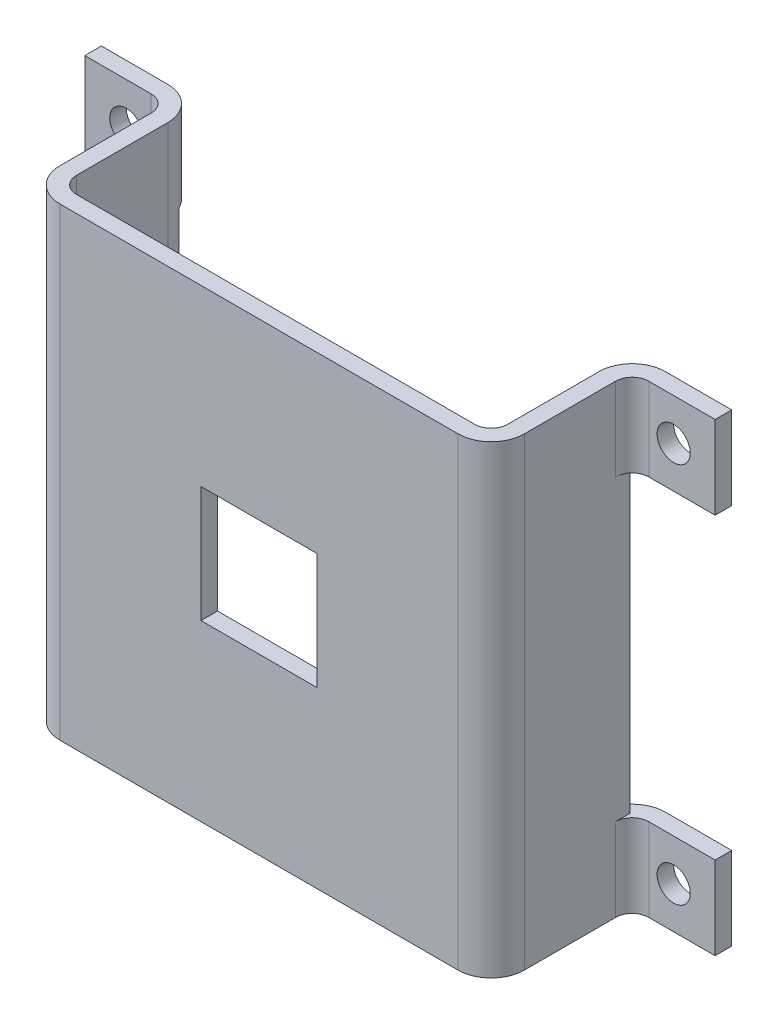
ISO-10303-21;
HEADER;
FILE_DESCRIPTION(('STEP AP214'),'2;1');
FILE_NAME('part.step','',(''),(''),'','','');
FILE_SCHEMA(('AUTOMOTIVE_DESIGN { 1 0 10303 214 1 1 1 1 }'));
ENDSEC;
DATA;
#1=APPLICATION_CONTEXT('core data for automotive mechanical design processes');
#2=APPLICATION_PROTOCOL_DEFINITION('international standard','automotive_design',2000,#1);
#3=PRODUCT_CONTEXT('',#1,'mechanical');
#4=PRODUCT('Part','Part','',(#3));
#5=PRODUCT_RELATED_PRODUCT_CATEGORY('part','',(#4));
#6=PRODUCT_DEFINITION_FORMATION('','',#4);
#7=PRODUCT_DEFINITION_CONTEXT('part definition',#1,'design');
#8=PRODUCT_DEFINITION('design','',#6,#7);
#9=PRODUCT_DEFINITION_SHAPE('','',#8);
#10=(LENGTH_UNIT() NAMED_UNIT(*) SI_UNIT(.MILLI.,.METRE.));
#11=(NAMED_UNIT(*) PLANE_ANGLE_UNIT() SI_UNIT($,.RADIAN.));
#12=(NAMED_UNIT(*) SI_UNIT($,.STERADIAN.) SOLID_ANGLE_UNIT());
#13=UNCERTAINTY_MEASURE_WITH_UNIT(LENGTH_MEASURE(1.E-05),#10,'distance_accuracy_value','');
#14=(GEOMETRIC_REPRESENTATION_CONTEXT(3) GLOBAL_UNCERTAINTY_ASSIGNED_CONTEXT((#13)) GLOBAL_UNIT_ASSIGNED_CONTEXT((#10,
#11,#12)) REPRESENTATION_CONTEXT('',''));
#15=CARTESIAN_POINT('',(0.,0.,0.));
#16=DIRECTION('',(0.,0.,1.));
#17=DIRECTION('',(1.,0.,0.));
#18=AXIS2_PLACEMENT_3D('',#15,#16,#17);
#19=CARTESIAN_POINT('',(14.,-14.,-8.5));
#20=DIRECTION('',(0.,0.,-1.));
#21=DIRECTION('',(-1.,0.,0.));
#22=AXIS2_PLACEMENT_3D('',#19,#20,#21);
#23=PLANE('',#22);
#24=CARTESIAN_POINT('',(16.5,-11.5,-8.5));
#25=DIRECTION('',(0.,0.,-1.));
#26=DIRECTION('',(-1.,0.,0.));
#27=AXIS2_PLACEMENT_3D('',#24,#25,#26);
#28=CIRCLE('',#27,1.);
#29=CARTESIAN_POINT('',(15.5,-11.5,-8.5));
#30=VERTEX_POINT('',#29);
#31=EDGE_CURVE('E388',#30,#30,#28,.T.);
#32=ORIENTED_EDGE('',*,*,#31,.F.);
#33=EDGE_LOOP('',(#32));
#34=FACE_BOUND('',#33,.T.);
#35=DIRECTION('',(-1.,0.,0.));
#36=VECTOR('',#35,1.);
#37=CARTESIAN_POINT('',(14.,-14.,-8.5));
#38=LINE('',#37,#36);
#39=CARTESIAN_POINT('',(19.,-14.,-8.5));
#40=VERTEX_POINT('',#39);
#41=CARTESIAN_POINT('',(15.,-14.,-8.5));
#42=VERTEX_POINT('',#41);
#43=EDGE_CURVE('E729',#40,#42,#38,.T.);
#44=ORIENTED_EDGE('',*,*,#43,.T.);
#45=DIRECTION('',(0.,1.,0.));
#46=VECTOR('',#45,1.);
#47=CARTESIAN_POINT('',(15.,14.,-8.5));
#48=LINE('',#47,#46);
#49=CARTESIAN_POINT('',(15.,-9.,-8.5));
#50=VERTEX_POINT('',#49);
#51=EDGE_CURVE('E695',#42,#50,#48,.T.);
#52=ORIENTED_EDGE('',*,*,#51,.T.);
#53=DIRECTION('',(-1.,0.,0.));
#54=VECTOR('',#53,1.);
#55=CARTESIAN_POINT('',(19.,-9.,-8.5));
#56=LINE('',#55,#54);
#57=CARTESIAN_POINT('',(19.,-9.,-8.5));
#58=VERTEX_POINT('',#57);
#59=EDGE_CURVE('E435',#58,#50,#56,.T.);
#60=ORIENTED_EDGE('',*,*,#59,.F.);
#61=DIRECTION('',(0.,1.,0.));
#62=VECTOR('',#61,1.);
#63=CARTESIAN_POINT('',(19.,-14.,-8.5));
#64=LINE('',#63,#62);
#65=EDGE_CURVE('E419',#40,#58,#64,.T.);
#66=ORIENTED_EDGE('',*,*,#65,.F.);
#67=EDGE_LOOP('',(#44,#52,#60,#66));
#68=FACE_BOUND('',#67,.T.);
#69=ADVANCED_FACE('F32',(#34,#68),#23,.T.);
#70=CARTESIAN_POINT('',(14.,14.,1.));
#71=DIRECTION('',(-1.,0.,0.));
#72=DIRECTION('',(0.,-1.,0.));
#73=AXIS2_PLACEMENT_3D('',#70,#71,#72);
#74=PLANE('',#73);
#75=DIRECTION('',(0.,0.,1.));
#76=VECTOR('',#75,1.);
#77=CARTESIAN_POINT('',(14.,-9.,-8.5));
#78=LINE('',#77,#76);
#79=CARTESIAN_POINT('',(14.,-9.,-7.36602540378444));
#80=VERTEX_POINT('',#79);
#81=CARTESIAN_POINT('',(14.,-9.,-6.5));
#82=VERTEX_POINT('',#81);
#83=EDGE_CURVE('E417',#80,#82,#78,.T.);
#84=ORIENTED_EDGE('',*,*,#83,.F.);
#85=DIRECTION('',(0.,-1.,0.));
#86=VECTOR('',#85,1.);
#87=CARTESIAN_POINT('',(14.,-9.,-7.36602540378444));
#88=LINE('',#87,#86);
#89=CARTESIAN_POINT('',(14.,9.,-7.36602540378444));
#90=VERTEX_POINT('',#89);
#91=EDGE_CURVE('E378',#90,#80,#88,.T.);
#92=ORIENTED_EDGE('',*,*,#91,.F.);
#93=DIRECTION('',(0.,0.,-1.));
#94=VECTOR('',#93,1.);
#95=CARTESIAN_POINT('',(14.,9.,-8.5));
#96=LINE('',#95,#94);
#97=CARTESIAN_POINT('',(14.,9.,-6.5));
#98=VERTEX_POINT('',#97);
#99=EDGE_CURVE('E438',#98,#90,#96,.T.);
#100=ORIENTED_EDGE('',*,*,#99,.F.);
#101=DIRECTION('',(0.,-1.,0.));
#102=VECTOR('',#101,1.);
#103=CARTESIAN_POINT('',(14.,14.,-6.5));
#104=LINE('',#103,#102);
#105=CARTESIAN_POINT('',(14.,14.,-6.5));
#106=VERTEX_POINT('',#105);
#107=EDGE_CURVE('E463',#98,#106,#104,.F.);
#108=ORIENTED_EDGE('',*,*,#107,.T.);
#109=DIRECTION('',(0.,0.,-1.));
#110=VECTOR('',#109,1.);
#111=CARTESIAN_POINT('',(14.,14.,1.));
#112=LINE('',#111,#110);
#113=CARTESIAN_POINT('',(14.,14.,-1.));
#114=VERTEX_POINT('',#113);
#115=EDGE_CURVE('E487',#114,#106,#112,.T.);
#116=ORIENTED_EDGE('',*,*,#115,.F.);
#117=DIRECTION('',(0.,1.,0.));
#118=VECTOR('',#117,1.);
#119=CARTESIAN_POINT('',(14.,-14.,-1.));
#120=LINE('',#119,#118);
#121=CARTESIAN_POINT('',(14.,-14.,-1.));
#122=VERTEX_POINT('',#121);
#123=EDGE_CURVE('E496',#114,#122,#120,.F.);
#124=ORIENTED_EDGE('',*,*,#123,.T.);
#125=DIRECTION('',(0.,0.,-1.));
#126=VECTOR('',#125,1.);
#127=CARTESIAN_POINT('',(14.,-14.,1.));
#128=LINE('',#127,#126);
#129=CARTESIAN_POINT('',(14.,-14.,-6.5));
#130=VERTEX_POINT('',#129);
#131=EDGE_CURVE('E460',#122,#130,#128,.T.);
#132=ORIENTED_EDGE('',*,*,#131,.T.);
#133=DIRECTION('',(0.,-1.,0.));
#134=VECTOR('',#133,1.);
#135=CARTESIAN_POINT('',(14.,-9.,-6.5));
#136=LINE('',#135,#134);
#137=EDGE_CURVE('E459',#130,#82,#136,.F.);
#138=ORIENTED_EDGE('',*,*,#137,.T.);
#139=EDGE_LOOP('',(#84,#92,#100,#108,#116,#124,#132,#138));
#140=FACE_BOUND('',#139,.T.);
#141=ADVANCED_FACE('F660',(#140),#74,.F.);
#142=CARTESIAN_POINT('',(0.,-14.,0.));
#143=DIRECTION('',(0.,0.,1.));
#144=DIRECTION('',(1.,0.,0.));
#145=AXIS2_PLACEMENT_3D('',#142,#143,#144);
#146=PLANE('',#145);
#147=DIRECTION('',(-1.,0.,0.));
#148=VECTOR('',#147,1.);
#149=CARTESIAN_POINT('',(0.,3.5,0.));
#150=LINE('',#149,#148);
#151=CARTESIAN_POINT('',(3.49999999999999,3.5,0.));
#152=VERTEX_POINT('',#151);
#153=CARTESIAN_POINT('',(-3.5,3.5,0.));
#154=VERTEX_POINT('',#153);
#155=EDGE_CURVE('E415',#152,#154,#150,.T.);
#156=ORIENTED_EDGE('',*,*,#155,.T.);
#157=DIRECTION('',(0.,1.,0.));
#158=VECTOR('',#157,1.);
#159=CARTESIAN_POINT('',(-3.49999999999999,-14.,0.));
#160=LINE('',#159,#158);
#161=CARTESIAN_POINT('',(-3.49999999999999,-3.5,0.));
#162=VERTEX_POINT('',#161);
#163=EDGE_CURVE('E617',#162,#154,#160,.T.);
#164=ORIENTED_EDGE('',*,*,#163,.F.);
#165=DIRECTION('',(1.,0.,0.));
#166=VECTOR('',#165,1.);
#167=CARTESIAN_POINT('',(0.,-3.5,0.));
#168=LINE('',#167,#166);
#169=CARTESIAN_POINT('',(3.5,-3.5,0.));
#170=VERTEX_POINT('',#169);
#171=EDGE_CURVE('E408',#162,#170,#168,.T.);
#172=ORIENTED_EDGE('',*,*,#171,.T.);
#173=DIRECTION('',(0.,1.,0.));
#174=VECTOR('',#173,1.);
#175=CARTESIAN_POINT('',(3.5,-14.,0.));
#176=LINE('',#175,#174);
#177=EDGE_CURVE('E412',#170,#152,#176,.T.);
#178=ORIENTED_EDGE('',*,*,#177,.T.);
#179=EDGE_LOOP('',(#156,#164,#172,#178));
#180=FACE_BOUND('',#179,.T.);
#181=DIRECTION('',(-1.,0.,0.));
#182=VECTOR('',#181,1.);
#183=CARTESIAN_POINT('',(0.,14.,0.));
#184=LINE('',#183,#182);
#185=CARTESIAN_POINT('',(12.,14.,0.));
#186=VERTEX_POINT('',#185);
#187=CARTESIAN_POINT('',(-12.,14.,0.));
#188=VERTEX_POINT('',#187);
#189=EDGE_CURVE('E473',#186,#188,#184,.T.);
#190=ORIENTED_EDGE('',*,*,#189,.F.);
#191=DIRECTION('',(0.,1.,0.));
#192=VECTOR('',#191,1.);
#193=CARTESIAN_POINT('',(12.,-14.,0.));
#194=LINE('',#193,#192);
#195=CARTESIAN_POINT('',(12.,-14.,0.));
#196=VERTEX_POINT('',#195);
#197=EDGE_CURVE('E472',#186,#196,#194,.F.);
#198=ORIENTED_EDGE('',*,*,#197,.T.);
#199=DIRECTION('',(1.,0.,0.));
#200=VECTOR('',#199,1.);
#201=CARTESIAN_POINT('',(0.,-14.,0.));
#202=LINE('',#201,#200);
#203=CARTESIAN_POINT('',(-12.,-14.,0.));
#204=VERTEX_POINT('',#203);
#205=EDGE_CURVE('E477',#204,#196,#202,.T.);
#206=ORIENTED_EDGE('',*,*,#205,.F.);
#207=DIRECTION('',(0.,1.,0.));
#208=VECTOR('',#207,1.);
#209=CARTESIAN_POINT('',(-12.,-14.,0.));
#210=LINE('',#209,#208);
#211=EDGE_CURVE('E577',#188,#204,#210,.F.);
#212=ORIENTED_EDGE('',*,*,#211,.F.);
#213=EDGE_LOOP('',(#190,#198,#206,#212));
#214=FACE_BOUND('',#213,.T.);
#215=ADVANCED_FACE('F667',(#180,#214),#146,.F.);
#216=CARTESIAN_POINT('',(0.,-14.,1.));
#217=DIRECTION('',(0.,1.,0.));
#218=DIRECTION('',(0.,0.,1.));
#219=AXIS2_PLACEMENT_3D('',#216,#217,#218);
#220=PLANE('',#219);
#221=DIRECTION('',(0.,0.,1.));
#222=VECTOR('',#221,1.);
#223=CARTESIAN_POINT('',(13.,-14.,-8.5));
#224=LINE('',#223,#222);
#225=CARTESIAN_POINT('',(13.,-14.,-6.5));
#226=VERTEX_POINT('',#225);
#227=CARTESIAN_POINT('',(13.,-14.,-1.));
#228=VERTEX_POINT('',#227);
#229=EDGE_CURVE('E503',#226,#228,#224,.T.);
#230=ORIENTED_EDGE('',*,*,#229,.F.);
#231=CARTESIAN_POINT('',(15.,-14.,-6.5));
#232=DIRECTION('',(0.,1.,0.));
#233=DIRECTION('',(0.,0.,1.));
#234=AXIS2_PLACEMENT_3D('',#231,#232,#233);
#235=CIRCLE('',#234,2.);
#236=EDGE_CURVE('E516',#226,#42,#235,.F.);
#237=ORIENTED_EDGE('',*,*,#236,.T.);
#238=ORIENTED_EDGE('',*,*,#43,.F.);
#239=DIRECTION('',(0.,0.,-1.));
#240=VECTOR('',#239,1.);
#241=CARTESIAN_POINT('',(19.,-14.,-8.5));
#242=LINE('',#241,#240);
#243=CARTESIAN_POINT('',(19.,-14.,-7.5));
#244=VERTEX_POINT('',#243);
#245=EDGE_CURVE('E426',#244,#40,#242,.T.);
#246=ORIENTED_EDGE('',*,*,#245,.F.);
#247=DIRECTION('',(-1.,0.,0.));
#248=VECTOR('',#247,1.);
#249=CARTESIAN_POINT('',(19.,-14.,-7.5));
#250=LINE('',#249,#248);
#251=CARTESIAN_POINT('',(15.,-14.,-7.5));
#252=VERTEX_POINT('',#251);
#253=EDGE_CURVE('E429',#244,#252,#250,.T.);
#254=ORIENTED_EDGE('',*,*,#253,.T.);
#255=CARTESIAN_POINT('',(15.,-14.,-6.5));
#256=DIRECTION('',(0.,1.,0.));
#257=DIRECTION('',(0.,0.,1.));
#258=AXIS2_PLACEMENT_3D('',#255,#256,#257);
#259=CIRCLE('',#258,1.);
#260=EDGE_CURVE('E706',#252,#130,#259,.T.);
#261=ORIENTED_EDGE('',*,*,#260,.T.);
#262=ORIENTED_EDGE('',*,*,#131,.F.);
#263=CARTESIAN_POINT('',(12.,-14.,-1.));
#264=DIRECTION('',(0.,1.,0.));
#265=DIRECTION('',(0.,0.,1.));
#266=AXIS2_PLACEMENT_3D('',#263,#264,#265);
#267=CIRCLE('',#266,2.);
#268=CARTESIAN_POINT('',(12.,-14.,1.));
#269=VERTEX_POINT('',#268);
#270=EDGE_CURVE('E55',#122,#269,#267,.F.);
#271=ORIENTED_EDGE('',*,*,#270,.T.);
#272=DIRECTION('',(1.,0.,0.));
#273=VECTOR('',#272,1.);
#274=CARTESIAN_POINT('',(0.,-14.,1.));
#275=LINE('',#274,#273);
#276=CARTESIAN_POINT('',(-12.,-14.,1.));
#277=VERTEX_POINT('',#276);
#278=EDGE_CURVE('E476',#277,#269,#275,.T.);
#279=ORIENTED_EDGE('',*,*,#278,.F.);
#280=CARTESIAN_POINT('',(-12.,-14.,-1.));
#281=DIRECTION('',(0.,-1.,0.));
#282=DIRECTION('',(0.,0.,1.));
#283=AXIS2_PLACEMENT_3D('',#280,#281,#282);
#284=CIRCLE('',#283,2.);
#285=CARTESIAN_POINT('',(-14.,-14.,-1.));
#286=VERTEX_POINT('',#285);
#287=EDGE_CURVE('E367',#286,#277,#284,.F.);
#288=ORIENTED_EDGE('',*,*,#287,.F.);
#289=DIRECTION('',(0.,0.,-1.));
#290=VECTOR('',#289,1.);
#291=CARTESIAN_POINT('',(-14.,-14.,1.));
#292=LINE('',#291,#290);
#293=CARTESIAN_POINT('',(-14.,-14.,-6.5));
#294=VERTEX_POINT('',#293);
#295=EDGE_CURVE('E341',#286,#294,#292,.T.);
#296=ORIENTED_EDGE('',*,*,#295,.T.);
#297=CARTESIAN_POINT('',(-15.,-14.,-6.5));
#298=DIRECTION('',(0.,-1.,0.));
#299=DIRECTION('',(0.,0.,1.));
#300=AXIS2_PLACEMENT_3D('',#297,#298,#299);
#301=CIRCLE('',#300,1.);
#302=CARTESIAN_POINT('',(-15.,-14.,-7.5));
#303=VERTEX_POINT('',#302);
#304=EDGE_CURVE('E570',#303,#294,#301,.T.);
#305=ORIENTED_EDGE('',*,*,#304,.F.);
#306=DIRECTION('',(1.,0.,0.));
#307=VECTOR('',#306,1.);
#308=CARTESIAN_POINT('',(-19.,-14.,-7.5));
#309=LINE('',#308,#307);
#310=CARTESIAN_POINT('',(-19.,-14.,-7.5));
#311=VERTEX_POINT('',#310);
#312=EDGE_CURVE('E602',#311,#303,#309,.T.);
#313=ORIENTED_EDGE('',*,*,#312,.F.);
#314=DIRECTION('',(0.,0.,-1.));
#315=VECTOR('',#314,1.);
#316=CARTESIAN_POINT('',(-19.,-14.,-8.5));
#317=LINE('',#316,#315);
#318=CARTESIAN_POINT('',(-19.,-14.,-8.5));
#319=VERTEX_POINT('',#318);
#320=EDGE_CURVE('E606',#311,#319,#317,.T.);
#321=ORIENTED_EDGE('',*,*,#320,.T.);
#322=DIRECTION('',(1.,0.,0.));
#323=VECTOR('',#322,1.);
#324=CARTESIAN_POINT('',(-14.,-14.,-8.5));
#325=LINE('',#324,#323);
#326=CARTESIAN_POINT('',(-15.,-14.,-8.5));
#327=VERTEX_POINT('',#326);
#328=EDGE_CURVE('E332',#319,#327,#325,.T.);
#329=ORIENTED_EDGE('',*,*,#328,.T.);
#330=CARTESIAN_POINT('',(-15.,-14.,-6.5));
#331=DIRECTION('',(0.,-1.,0.));
#332=DIRECTION('',(0.,0.,1.));
#333=AXIS2_PLACEMENT_3D('',#330,#331,#332);
#334=CIRCLE('',#333,2.);
#335=CARTESIAN_POINT('',(-13.,-14.,-6.5));
#336=VERTEX_POINT('',#335);
#337=EDGE_CURVE('E370',#336,#327,#334,.F.);
#338=ORIENTED_EDGE('',*,*,#337,.F.);
#339=DIRECTION('',(0.,0.,1.));
#340=VECTOR('',#339,1.);
#341=CARTESIAN_POINT('',(-13.,-14.,-8.5));
#342=LINE('',#341,#340);
#343=CARTESIAN_POINT('',(-13.,-14.,-1.));
#344=VERTEX_POINT('',#343);
#345=EDGE_CURVE('E347',#336,#344,#342,.T.);
#346=ORIENTED_EDGE('',*,*,#345,.T.);
#347=CARTESIAN_POINT('',(-12.,-14.,-1.));
#348=DIRECTION('',(0.,-1.,0.));
#349=DIRECTION('',(0.,0.,1.));
#350=AXIS2_PLACEMENT_3D('',#347,#348,#349);
#351=CIRCLE('',#350,1.);
#352=EDGE_CURVE('E552',#204,#344,#351,.T.);
#353=ORIENTED_EDGE('',*,*,#352,.F.);
#354=ORIENTED_EDGE('',*,*,#205,.T.);
#355=CARTESIAN_POINT('',(12.,-14.,-1.));
#356=DIRECTION('',(0.,1.,0.));
#357=DIRECTION('',(0.,0.,1.));
#358=AXIS2_PLACEMENT_3D('',#355,#356,#357);
#359=CIRCLE('',#358,1.);
#360=EDGE_CURVE('E696',#196,#228,#359,.T.);
#361=ORIENTED_EDGE('',*,*,#360,.T.);
#362=EDGE_LOOP('',(#230,#237,#238,#246,#254,#261,#262,#271,#279,#288,#296,#305,#313,#321,#329,
#338,#346,#353,#354,#361));
#363=FACE_BOUND('',#362,.T.);
#364=ADVANCED_FACE('F34',(#363),#220,.F.);
#365=CARTESIAN_POINT('',(0.,14.,1.));
#366=DIRECTION('',(0.,-1.,0.));
#367=DIRECTION('',(0.,0.,-1.));
#368=AXIS2_PLACEMENT_3D('',#365,#366,#367);
#369=PLANE('',#368);
#370=DIRECTION('',(1.,0.,0.));
#371=VECTOR('',#370,1.);
#372=CARTESIAN_POINT('',(14.,14.,-8.5));
#373=LINE('',#372,#371);
#374=CARTESIAN_POINT('',(15.,14.,-8.5));
#375=VERTEX_POINT('',#374);
#376=CARTESIAN_POINT('',(19.,14.,-8.5));
#377=VERTEX_POINT('',#376);
#378=EDGE_CURVE('E504',#375,#377,#373,.T.);
#379=ORIENTED_EDGE('',*,*,#378,.F.);
#380=CARTESIAN_POINT('',(15.,14.,-6.5));
#381=DIRECTION('',(0.,-1.,0.));
#382=DIRECTION('',(0.,0.,-1.));
#383=AXIS2_PLACEMENT_3D('',#380,#381,#382);
#384=CIRCLE('',#383,2.);
#385=CARTESIAN_POINT('',(13.,14.,-6.5));
#386=VERTEX_POINT('',#385);
#387=EDGE_CURVE('E512',#375,#386,#384,.F.);
#388=ORIENTED_EDGE('',*,*,#387,.T.);
#389=DIRECTION('',(0.,0.,1.));
#390=VECTOR('',#389,1.);
#391=CARTESIAN_POINT('',(13.,14.,-8.5));
#392=LINE('',#391,#390);
#393=CARTESIAN_POINT('',(13.,14.,-1.));
#394=VERTEX_POINT('',#393);
#395=EDGE_CURVE('E500',#386,#394,#392,.T.);
#396=ORIENTED_EDGE('',*,*,#395,.T.);
#397=CARTESIAN_POINT('',(12.,14.,-1.));
#398=DIRECTION('',(0.,-1.,0.));
#399=DIRECTION('',(0.,0.,-1.));
#400=AXIS2_PLACEMENT_3D('',#397,#398,#399);
#401=CIRCLE('',#400,1.);
#402=EDGE_CURVE('E700',#394,#186,#401,.T.);
#403=ORIENTED_EDGE('',*,*,#402,.T.);
#404=ORIENTED_EDGE('',*,*,#189,.T.);
#405=CARTESIAN_POINT('',(-12.,14.,-1.));
#406=DIRECTION('',(0.,1.,0.));
#407=DIRECTION('',(0.,0.,-1.));
#408=AXIS2_PLACEMENT_3D('',#405,#406,#407);
#409=CIRCLE('',#408,1.);
#410=CARTESIAN_POINT('',(-13.,14.,-1.));
#411=VERTEX_POINT('',#410);
#412=EDGE_CURVE('E543',#411,#188,#409,.T.);
#413=ORIENTED_EDGE('',*,*,#412,.F.);
#414=DIRECTION('',(0.,0.,1.));
#415=VECTOR('',#414,1.);
#416=CARTESIAN_POINT('',(-13.,14.,-8.5));
#417=LINE('',#416,#415);
#418=CARTESIAN_POINT('',(-13.,14.,-6.5));
#419=VERTEX_POINT('',#418);
#420=EDGE_CURVE('E338',#419,#411,#417,.T.);
#421=ORIENTED_EDGE('',*,*,#420,.F.);
#422=CARTESIAN_POINT('',(-15.,14.,-6.5));
#423=DIRECTION('',(0.,1.,0.));
#424=DIRECTION('',(0.,0.,-1.));
#425=AXIS2_PLACEMENT_3D('',#422,#423,#424);
#426=CIRCLE('',#425,2.);
#427=CARTESIAN_POINT('',(-15.,14.,-8.5));
#428=VERTEX_POINT('',#427);
#429=EDGE_CURVE('E364',#428,#419,#426,.F.);
#430=ORIENTED_EDGE('',*,*,#429,.F.);
#431=DIRECTION('',(-1.,0.,0.));
#432=VECTOR('',#431,1.);
#433=CARTESIAN_POINT('',(-14.,14.,-8.5));
#434=LINE('',#433,#432);
#435=CARTESIAN_POINT('',(-19.,14.,-8.5));
#436=VERTEX_POINT('',#435);
#437=EDGE_CURVE('E335',#428,#436,#434,.T.);
#438=ORIENTED_EDGE('',*,*,#437,.T.);
#439=DIRECTION('',(0.,0.,1.));
#440=VECTOR('',#439,1.);
#441=CARTESIAN_POINT('',(-19.,14.,-8.5));
#442=LINE('',#441,#440);
#443=CARTESIAN_POINT('',(-19.,14.,-7.5));
#444=VERTEX_POINT('',#443);
#445=EDGE_CURVE('E306',#436,#444,#442,.T.);
#446=ORIENTED_EDGE('',*,*,#445,.T.);
#447=DIRECTION('',(1.,0.,0.));
#448=VECTOR('',#447,1.);
#449=CARTESIAN_POINT('',(-19.,14.,-7.5));
#450=LINE('',#449,#448);
#451=CARTESIAN_POINT('',(-15.,14.,-7.5));
#452=VERTEX_POINT('',#451);
#453=EDGE_CURVE('E331',#444,#452,#450,.T.);
#454=ORIENTED_EDGE('',*,*,#453,.T.);
#455=CARTESIAN_POINT('',(-15.,14.,-6.5));
#456=DIRECTION('',(0.,1.,0.));
#457=DIRECTION('',(0.,0.,-1.));
#458=AXIS2_PLACEMENT_3D('',#455,#456,#457);
#459=CIRCLE('',#458,1.);
#460=CARTESIAN_POINT('',(-14.,14.,-6.5));
#461=VERTEX_POINT('',#460);
#462=EDGE_CURVE('E572',#461,#452,#459,.T.);
#463=ORIENTED_EDGE('',*,*,#462,.F.);
#464=DIRECTION('',(0.,0.,-1.));
#465=VECTOR('',#464,1.);
#466=CARTESIAN_POINT('',(-14.,14.,1.));
#467=LINE('',#466,#465);
#468=CARTESIAN_POINT('',(-14.,14.,-1.));
#469=VERTEX_POINT('',#468);
#470=EDGE_CURVE('E344',#469,#461,#467,.T.);
#471=ORIENTED_EDGE('',*,*,#470,.F.);
#472=CARTESIAN_POINT('',(-12.,14.,-1.));
#473=DIRECTION('',(0.,1.,0.));
#474=DIRECTION('',(0.,0.,-1.));
#475=AXIS2_PLACEMENT_3D('',#472,#473,#474);
#476=CIRCLE('',#475,2.);
#477=CARTESIAN_POINT('',(-12.,14.,1.));
#478=VERTEX_POINT('',#477);
#479=EDGE_CURVE('E354',#478,#469,#476,.F.);
#480=ORIENTED_EDGE('',*,*,#479,.F.);
#481=DIRECTION('',(-1.,0.,0.));
#482=VECTOR('',#481,1.);
#483=CARTESIAN_POINT('',(0.,14.,1.));
#484=LINE('',#483,#482);
#485=CARTESIAN_POINT('',(12.,14.,1.));
#486=VERTEX_POINT('',#485);
#487=EDGE_CURVE('E485',#486,#478,#484,.T.);
#488=ORIENTED_EDGE('',*,*,#487,.F.);
#489=CARTESIAN_POINT('',(12.,14.,-1.));
#490=DIRECTION('',(0.,-1.,0.));
#491=DIRECTION('',(0.,0.,-1.));
#492=AXIS2_PLACEMENT_3D('',#489,#490,#491);
#493=CIRCLE('',#492,2.);
#494=EDGE_CURVE('E499',#486,#114,#493,.F.);
#495=ORIENTED_EDGE('',*,*,#494,.T.);
#496=ORIENTED_EDGE('',*,*,#115,.T.);
#497=CARTESIAN_POINT('',(15.,14.,-6.5));
#498=DIRECTION('',(0.,-1.,0.));
#499=DIRECTION('',(0.,0.,-1.));
#500=AXIS2_PLACEMENT_3D('',#497,#498,#499);
#501=CIRCLE('',#500,1.);
#502=CARTESIAN_POINT('',(15.,14.,-7.5));
#503=VERTEX_POINT('',#502);
#504=EDGE_CURVE('E709',#106,#503,#501,.T.);
#505=ORIENTED_EDGE('',*,*,#504,.T.);
#506=DIRECTION('',(-1.,0.,0.));
#507=VECTOR('',#506,1.);
#508=CARTESIAN_POINT('',(19.,14.,-7.5));
#509=LINE('',#508,#507);
#510=CARTESIAN_POINT('',(19.,14.,-7.5));
#511=VERTEX_POINT('',#510);
#512=EDGE_CURVE('E509',#511,#503,#509,.T.);
#513=ORIENTED_EDGE('',*,*,#512,.F.);
#514=DIRECTION('',(0.,0.,1.));
#515=VECTOR('',#514,1.);
#516=CARTESIAN_POINT('',(19.,14.,-8.5));
#517=LINE('',#516,#515);
#518=EDGE_CURVE('E745',#377,#511,#517,.T.);
#519=ORIENTED_EDGE('',*,*,#518,.F.);
#520=EDGE_LOOP('',(#379,#388,#396,#403,#404,#413,#421,#430,#438,#446,#454,#463,#471,#480,#488,
#495,#496,#505,#513,#519));
#521=FACE_BOUND('',#520,.T.);
#522=ADVANCED_FACE('F527',(#521),#369,.F.);
#523=CARTESIAN_POINT('',(0.,-14.,1.));
#524=DIRECTION('',(0.,0.,1.));
#525=DIRECTION('',(1.,0.,0.));
#526=AXIS2_PLACEMENT_3D('',#523,#524,#525);
#527=PLANE('',#526);
#528=DIRECTION('',(0.,1.,0.));
#529=VECTOR('',#528,1.);
#530=CARTESIAN_POINT('',(-3.5,3.5,1.));
#531=LINE('',#530,#529);
#532=CARTESIAN_POINT('',(-3.49999999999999,-3.5,1.));
#533=VERTEX_POINT('',#532);
#534=CARTESIAN_POINT('',(-3.5,3.5,1.));
#535=VERTEX_POINT('',#534);
#536=EDGE_CURVE('E624',#533,#535,#531,.T.);
#537=ORIENTED_EDGE('',*,*,#536,.T.);
#538=DIRECTION('',(-1.,0.,0.));
#539=VECTOR('',#538,1.);
#540=CARTESIAN_POINT('',(0.,3.5,1.));
#541=LINE('',#540,#539);
#542=CARTESIAN_POINT('',(3.49999999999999,3.5,1.));
#543=VERTEX_POINT('',#542);
#544=EDGE_CURVE('E403',#543,#535,#541,.T.);
#545=ORIENTED_EDGE('',*,*,#544,.F.);
#546=DIRECTION('',(0.,1.,0.));
#547=VECTOR('',#546,1.);
#548=CARTESIAN_POINT('',(3.49999999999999,3.5,1.));
#549=LINE('',#548,#547);
#550=CARTESIAN_POINT('',(3.5,-3.5,1.));
#551=VERTEX_POINT('',#550);
#552=EDGE_CURVE('E400',#551,#543,#549,.T.);
#553=ORIENTED_EDGE('',*,*,#552,.F.);
#554=DIRECTION('',(1.,0.,0.));
#555=VECTOR('',#554,1.);
#556=CARTESIAN_POINT('',(0.,-3.5,1.));
#557=LINE('',#556,#555);
#558=EDGE_CURVE('E397',#533,#551,#557,.T.);
#559=ORIENTED_EDGE('',*,*,#558,.F.);
#560=EDGE_LOOP('',(#537,#545,#553,#559));
#561=FACE_BOUND('',#560,.T.);
#562=ORIENTED_EDGE('',*,*,#278,.T.);
#563=DIRECTION('',(0.,1.,0.));
#564=VECTOR('',#563,1.);
#565=CARTESIAN_POINT('',(12.,14.,1.));
#566=LINE('',#565,#564);
#567=EDGE_CURVE('E40',#269,#486,#566,.T.);
#568=ORIENTED_EDGE('',*,*,#567,.T.);
#569=ORIENTED_EDGE('',*,*,#487,.T.);
#570=DIRECTION('',(0.,1.,0.));
#571=VECTOR('',#570,1.);
#572=CARTESIAN_POINT('',(-12.,14.,1.));
#573=LINE('',#572,#571);
#574=EDGE_CURVE('E372',#277,#478,#573,.T.);
#575=ORIENTED_EDGE('',*,*,#574,.F.);
#576=EDGE_LOOP('',(#562,#568,#569,#575));
#577=FACE_BOUND('',#576,.T.);
#578=ADVANCED_FACE('F521',(#561,#577),#527,.T.);
#579=CARTESIAN_POINT('',(13.,14.,-8.5));
#580=DIRECTION('',(1.,0.,0.));
#581=DIRECTION('',(0.,1.,0.));
#582=AXIS2_PLACEMENT_3D('',#579,#580,#581);
#583=PLANE('',#582);
#584=ORIENTED_EDGE('',*,*,#395,.F.);
#585=DIRECTION('',(0.,1.,0.));
#586=VECTOR('',#585,1.);
#587=CARTESIAN_POINT('',(13.,-14.,-6.5));
#588=LINE('',#587,#586);
#589=EDGE_CURVE('E513',#386,#226,#588,.F.);
#590=ORIENTED_EDGE('',*,*,#589,.T.);
#591=ORIENTED_EDGE('',*,*,#229,.T.);
#592=DIRECTION('',(0.,1.,0.));
#593=VECTOR('',#592,1.);
#594=CARTESIAN_POINT('',(13.,14.,-1.));
#595=LINE('',#594,#593);
#596=EDGE_CURVE('E469',#228,#394,#595,.T.);
#597=ORIENTED_EDGE('',*,*,#596,.T.);
#598=EDGE_LOOP('',(#584,#590,#591,#597));
#599=FACE_BOUND('',#598,.T.);
#600=ADVANCED_FACE('F675',(#599),#583,.F.);
#601=CARTESIAN_POINT('',(16.5,11.5,-8.5));
#602=DIRECTION('',(0.,0.,-1.));
#603=DIRECTION('',(-1.,0.,0.));
#604=AXIS2_PLACEMENT_3D('',#601,#602,#603);
#605=CIRCLE('',#604,1.);
#606=CARTESIAN_POINT('',(15.5,11.5,-8.5));
#607=VERTEX_POINT('',#606);
#608=EDGE_CURVE('E394',#607,#607,#605,.T.);
#609=ORIENTED_EDGE('',*,*,#608,.F.);
#610=EDGE_LOOP('',(#609));
#611=FACE_BOUND('',#610,.T.);
#612=DIRECTION('',(-1.,0.,0.));
#613=VECTOR('',#612,1.);
#614=CARTESIAN_POINT('',(19.,9.,-8.5));
#615=LINE('',#614,#613);
#616=CARTESIAN_POINT('',(19.,9.,-8.5));
#617=VERTEX_POINT('',#616);
#618=CARTESIAN_POINT('',(15.,9.,-8.5));
#619=VERTEX_POINT('',#618);
#620=EDGE_CURVE('E449',#617,#619,#615,.T.);
#621=ORIENTED_EDGE('',*,*,#620,.T.);
#622=DIRECTION('',(0.,1.,0.));
#623=VECTOR('',#622,1.);
#624=CARTESIAN_POINT('',(15.,14.,-8.5));
#625=LINE('',#624,#623);
#626=EDGE_CURVE('E688',#619,#375,#625,.T.);
#627=ORIENTED_EDGE('',*,*,#626,.T.);
#628=ORIENTED_EDGE('',*,*,#378,.T.);
#629=DIRECTION('',(0.,1.,0.));
#630=VECTOR('',#629,1.);
#631=CARTESIAN_POINT('',(19.,14.,-8.5));
#632=LINE('',#631,#630);
#633=EDGE_CURVE('E441',#617,#377,#632,.T.);
#634=ORIENTED_EDGE('',*,*,#633,.F.);
#635=EDGE_LOOP('',(#621,#627,#628,#634));
#636=FACE_BOUND('',#635,.T.);
#637=ADVANCED_FACE('F663',(#611,#636),#23,.T.);
#638=CARTESIAN_POINT('',(19.,14.,-7.5));
#639=DIRECTION('',(0.,0.,-1.));
#640=DIRECTION('',(0.,1.,0.));
#641=AXIS2_PLACEMENT_3D('',#638,#639,#640);
#642=PLANE('',#641);
#643=CARTESIAN_POINT('',(16.5,11.5,-7.5));
#644=DIRECTION('',(0.,0.,1.));
#645=DIRECTION('',(1.,0.,0.));
#646=AXIS2_PLACEMENT_3D('',#643,#644,#645);
#647=CIRCLE('',#646,1.);
#648=CARTESIAN_POINT('',(17.5,11.5,-7.5));
#649=VERTEX_POINT('',#648);
#650=EDGE_CURVE('E391',#649,#649,#647,.T.);
#651=ORIENTED_EDGE('',*,*,#650,.F.);
#652=EDGE_LOOP('',(#651));
#653=FACE_BOUND('',#652,.T.);
#654=ORIENTED_EDGE('',*,*,#512,.T.);
#655=DIRECTION('',(0.,-1.,0.));
#656=VECTOR('',#655,1.);
#657=CARTESIAN_POINT('',(15.,9.,-7.5));
#658=LINE('',#657,#656);
#659=CARTESIAN_POINT('',(15.,9.,-7.5));
#660=VERTEX_POINT('',#659);
#661=EDGE_CURVE('E456',#503,#660,#658,.T.);
#662=ORIENTED_EDGE('',*,*,#661,.T.);
#663=DIRECTION('',(-1.,0.,0.));
#664=VECTOR('',#663,1.);
#665=CARTESIAN_POINT('',(19.,9.,-7.5));
#666=LINE('',#665,#664);
#667=CARTESIAN_POINT('',(19.,9.,-7.5));
#668=VERTEX_POINT('',#667);
#669=EDGE_CURVE('E452',#668,#660,#666,.T.);
#670=ORIENTED_EDGE('',*,*,#669,.F.);
#671=DIRECTION('',(0.,-1.,0.));
#672=VECTOR('',#671,1.);
#673=CARTESIAN_POINT('',(19.,14.,-7.5));
#674=LINE('',#673,#672);
#675=EDGE_CURVE('E744',#511,#668,#674,.T.);
#676=ORIENTED_EDGE('',*,*,#675,.F.);
#677=EDGE_LOOP('',(#654,#662,#670,#676));
#678=FACE_BOUND('',#677,.T.);
#679=ADVANCED_FACE('F674',(#653,#678),#642,.F.);
#680=CARTESIAN_POINT('',(19.,9.,-8.5));
#681=DIRECTION('',(0.,1.,0.));
#682=DIRECTION('',(-1.,0.,0.));
#683=AXIS2_PLACEMENT_3D('',#680,#681,#682);
#684=PLANE('',#683);
#685=ORIENTED_EDGE('',*,*,#99,.T.);
#686=DIRECTION('',(1.,0.,0.));
#687=VECTOR('',#686,1.);
#688=CARTESIAN_POINT('',(0.,9.,-7.36602540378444));
#689=LINE('',#688,#687);
#690=CARTESIAN_POINT('',(13.197224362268,9.,-7.36602540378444));
#691=VERTEX_POINT('',#690);
#692=EDGE_CURVE('E381',#691,#90,#689,.T.);
#693=ORIENTED_EDGE('',*,*,#692,.F.);
#694=CARTESIAN_POINT('',(15.,9.,-6.5));
#695=DIRECTION('',(0.,1.,0.));
#696=DIRECTION('',(-1.,0.,0.));
#697=AXIS2_PLACEMENT_3D('',#694,#695,#696);
#698=CIRCLE('',#697,2.);
#699=EDGE_CURVE('E47',#691,#619,#698,.F.);
#700=ORIENTED_EDGE('',*,*,#699,.T.);
#701=ORIENTED_EDGE('',*,*,#620,.F.);
#702=DIRECTION('',(0.,0.,-1.));
#703=VECTOR('',#702,1.);
#704=CARTESIAN_POINT('',(19.,9.,-8.5));
#705=LINE('',#704,#703);
#706=EDGE_CURVE('E453',#668,#617,#705,.T.);
#707=ORIENTED_EDGE('',*,*,#706,.F.);
#708=ORIENTED_EDGE('',*,*,#669,.T.);
#709=CARTESIAN_POINT('',(15.,9.,-6.5));
#710=DIRECTION('',(0.,1.,0.));
#711=DIRECTION('',(-1.,0.,0.));
#712=AXIS2_PLACEMENT_3D('',#709,#710,#711);
#713=CIRCLE('',#712,1.);
#714=EDGE_CURVE('E710',#660,#98,#713,.T.);
#715=ORIENTED_EDGE('',*,*,#714,.T.);
#716=EDGE_LOOP('',(#685,#693,#700,#701,#707,#708,#715));
#717=FACE_BOUND('',#716,.T.);
#718=ADVANCED_FACE('F681',(#717),#684,.F.);
#719=CARTESIAN_POINT('',(19.,9.,-8.5));
#720=DIRECTION('',(-1.,0.,0.));
#721=DIRECTION('',(0.,0.,1.));
#722=AXIS2_PLACEMENT_3D('',#719,#720,#721);
#723=PLANE('',#722);
#724=ORIENTED_EDGE('',*,*,#633,.T.);
#725=ORIENTED_EDGE('',*,*,#518,.T.);
#726=ORIENTED_EDGE('',*,*,#675,.T.);
#727=ORIENTED_EDGE('',*,*,#706,.T.);
#728=EDGE_LOOP('',(#724,#725,#726,#727));
#729=FACE_BOUND('',#728,.T.);
#730=ADVANCED_FACE('F749',(#729),#723,.F.);
#731=CARTESIAN_POINT('',(19.,-9.,-8.5));
#732=DIRECTION('',(0.,-1.,0.));
#733=DIRECTION('',(1.,0.,0.));
#734=AXIS2_PLACEMENT_3D('',#731,#732,#733);
#735=PLANE('',#734);
#736=ORIENTED_EDGE('',*,*,#59,.T.);
#737=CARTESIAN_POINT('',(15.,-9.,-6.5));
#738=DIRECTION('',(0.,-1.,0.));
#739=DIRECTION('',(1.,0.,0.));
#740=AXIS2_PLACEMENT_3D('',#737,#738,#739);
#741=CIRCLE('',#740,2.);
#742=CARTESIAN_POINT('',(13.197224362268,-9.,-7.36602540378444));
#743=VERTEX_POINT('',#742);
#744=EDGE_CURVE('E494',#50,#743,#741,.F.);
#745=ORIENTED_EDGE('',*,*,#744,.T.);
#746=DIRECTION('',(1.,0.,0.));
#747=VECTOR('',#746,1.);
#748=CARTESIAN_POINT('',(0.,-9.,-7.36602540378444));
#749=LINE('',#748,#747);
#750=EDGE_CURVE('E382',#743,#80,#749,.T.);
#751=ORIENTED_EDGE('',*,*,#750,.T.);
#752=ORIENTED_EDGE('',*,*,#83,.T.);
#753=CARTESIAN_POINT('',(15.,-9.,-6.5));
#754=DIRECTION('',(0.,-1.,0.));
#755=DIRECTION('',(1.,0.,0.));
#756=AXIS2_PLACEMENT_3D('',#753,#754,#755);
#757=CIRCLE('',#756,1.);
#758=CARTESIAN_POINT('',(15.,-9.,-7.5));
#759=VERTEX_POINT('',#758);
#760=EDGE_CURVE('E704',#82,#759,#757,.T.);
#761=ORIENTED_EDGE('',*,*,#760,.T.);
#762=DIRECTION('',(-1.,0.,0.));
#763=VECTOR('',#762,1.);
#764=CARTESIAN_POINT('',(19.,-9.,-7.5));
#765=LINE('',#764,#763);
#766=CARTESIAN_POINT('',(19.,-9.,-7.5));
#767=VERTEX_POINT('',#766);
#768=EDGE_CURVE('E432',#767,#759,#765,.T.);
#769=ORIENTED_EDGE('',*,*,#768,.F.);
#770=DIRECTION('',(0.,0.,1.));
#771=VECTOR('',#770,1.);
#772=CARTESIAN_POINT('',(19.,-9.,-8.5));
#773=LINE('',#772,#771);
#774=EDGE_CURVE('E422',#58,#767,#773,.T.);
#775=ORIENTED_EDGE('',*,*,#774,.F.);
#776=EDGE_LOOP('',(#736,#745,#751,#752,#761,#769,#775));
#777=FACE_BOUND('',#776,.T.);
#778=ADVANCED_FACE('F731',(#777),#735,.F.);
#779=CARTESIAN_POINT('',(19.,-14.,-7.5));
#780=DIRECTION('',(0.,0.,-1.));
#781=DIRECTION('',(-1.,0.,0.));
#782=AXIS2_PLACEMENT_3D('',#779,#780,#781);
#783=PLANE('',#782);
#784=CARTESIAN_POINT('',(16.5,-11.5,-7.5));
#785=DIRECTION('',(0.,0.,1.));
#786=DIRECTION('',(1.,0.,0.));
#787=AXIS2_PLACEMENT_3D('',#784,#785,#786);
#788=CIRCLE('',#787,1.);
#789=CARTESIAN_POINT('',(17.5,-11.5,-7.5));
#790=VERTEX_POINT('',#789);
#791=EDGE_CURVE('E384',#790,#790,#788,.T.);
#792=ORIENTED_EDGE('',*,*,#791,.F.);
#793=EDGE_LOOP('',(#792));
#794=FACE_BOUND('',#793,.T.);
#795=ORIENTED_EDGE('',*,*,#768,.T.);
#796=DIRECTION('',(0.,-1.,0.));
#797=VECTOR('',#796,1.);
#798=CARTESIAN_POINT('',(15.,-14.,-7.5));
#799=LINE('',#798,#797);
#800=EDGE_CURVE('E466',#759,#252,#799,.T.);
#801=ORIENTED_EDGE('',*,*,#800,.T.);
#802=ORIENTED_EDGE('',*,*,#253,.F.);
#803=DIRECTION('',(0.,-1.,0.));
#804=VECTOR('',#803,1.);
#805=CARTESIAN_POINT('',(19.,-14.,-7.5));
#806=LINE('',#805,#804);
#807=EDGE_CURVE('E424',#767,#244,#806,.T.);
#808=ORIENTED_EDGE('',*,*,#807,.F.);
#809=EDGE_LOOP('',(#795,#801,#802,#808));
#810=FACE_BOUND('',#809,.T.);
#811=ADVANCED_FACE('F768',(#794,#810),#783,.F.);
#812=CARTESIAN_POINT('',(19.,-9.,-8.5));
#813=DIRECTION('',(1.,0.,0.));
#814=DIRECTION('',(0.,0.,-1.));
#815=AXIS2_PLACEMENT_3D('',#812,#813,#814);
#816=PLANE('',#815);
#817=ORIENTED_EDGE('',*,*,#65,.T.);
#818=ORIENTED_EDGE('',*,*,#774,.T.);
#819=ORIENTED_EDGE('',*,*,#807,.T.);
#820=ORIENTED_EDGE('',*,*,#245,.T.);
#821=EDGE_LOOP('',(#817,#818,#819,#820));
#822=FACE_BOUND('',#821,.T.);
#823=ADVANCED_FACE('F736',(#822),#816,.T.);
#824=CARTESIAN_POINT('',(0.,3.5,-8.50005));
#825=DIRECTION('',(0.,1.,0.));
#826=DIRECTION('',(0.,0.,1.));
#827=AXIS2_PLACEMENT_3D('',#824,#825,#826);
#828=PLANE('',#827);
#829=DIRECTION('',(0.,0.,1.));
#830=VECTOR('',#829,1.);
#831=CARTESIAN_POINT('',(3.49999999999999,3.5,-8.50005));
#832=LINE('',#831,#830);
#833=EDGE_CURVE('E406',#152,#543,#832,.T.);
#834=ORIENTED_EDGE('',*,*,#833,.T.);
#835=ORIENTED_EDGE('',*,*,#544,.T.);
#836=DIRECTION('',(0.,0.,1.));
#837=VECTOR('',#836,1.);
#838=CARTESIAN_POINT('',(-3.5,3.5,-8.50005));
#839=LINE('',#838,#837);
#840=EDGE_CURVE('E620',#154,#535,#839,.T.);
#841=ORIENTED_EDGE('',*,*,#840,.F.);
#842=ORIENTED_EDGE('',*,*,#155,.F.);
#843=EDGE_LOOP('',(#834,#835,#841,#842));
#844=FACE_BOUND('',#843,.T.);
#845=ADVANCED_FACE('F776',(#844),#828,.F.);
#846=CARTESIAN_POINT('',(3.49999999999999,3.5,-8.50005));
#847=DIRECTION('',(1.,0.,0.));
#848=DIRECTION('',(0.,1.,0.));
#849=AXIS2_PLACEMENT_3D('',#846,#847,#848);
#850=PLANE('',#849);
#851=DIRECTION('',(0.,0.,1.));
#852=VECTOR('',#851,1.);
#853=CARTESIAN_POINT('',(3.5,-3.5,-8.50005));
#854=LINE('',#853,#852);
#855=EDGE_CURVE('E405',#170,#551,#854,.T.);
#856=ORIENTED_EDGE('',*,*,#855,.T.);
#857=ORIENTED_EDGE('',*,*,#552,.T.);
#858=ORIENTED_EDGE('',*,*,#833,.F.);
#859=ORIENTED_EDGE('',*,*,#177,.F.);
#860=EDGE_LOOP('',(#856,#857,#858,#859));
#861=FACE_BOUND('',#860,.T.);
#862=ADVANCED_FACE('F867',(#861),#850,.F.);
#863=CARTESIAN_POINT('',(0.,-3.5,-8.50005));
#864=DIRECTION('',(0.,-1.,0.));
#865=DIRECTION('',(1.,0.,0.));
#866=AXIS2_PLACEMENT_3D('',#863,#864,#865);
#867=PLANE('',#866);
#868=ORIENTED_EDGE('',*,*,#171,.F.);
#869=DIRECTION('',(0.,0.,1.));
#870=VECTOR('',#869,1.);
#871=CARTESIAN_POINT('',(-3.49999999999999,-3.5,-8.50005));
#872=LINE('',#871,#870);
#873=EDGE_CURVE('E621',#162,#533,#872,.T.);
#874=ORIENTED_EDGE('',*,*,#873,.T.);
#875=ORIENTED_EDGE('',*,*,#558,.T.);
#876=ORIENTED_EDGE('',*,*,#855,.F.);
#877=EDGE_LOOP('',(#868,#874,#875,#876));
#878=FACE_BOUND('',#877,.T.);
#879=ADVANCED_FACE('F876',(#878),#867,.F.);
#880=CARTESIAN_POINT('',(16.5,11.5,-8.50005));
#881=DIRECTION('',(0.,0.,1.));
#882=DIRECTION('',(1.,0.,0.));
#883=AXIS2_PLACEMENT_3D('',#880,#881,#882);
#884=CYLINDRICAL_SURFACE('',#883,1.);
#885=ORIENTED_EDGE('',*,*,#608,.T.);
#886=EDGE_LOOP('',(#885));
#887=FACE_BOUND('',#886,.T.);
#888=ORIENTED_EDGE('',*,*,#650,.T.);
#889=EDGE_LOOP('',(#888));
#890=FACE_BOUND('',#889,.T.);
#891=ADVANCED_FACE('F880',(#887,#890),#884,.F.);
#892=CARTESIAN_POINT('',(16.5,-11.5,-8.50005));
#893=DIRECTION('',(0.,0.,1.));
#894=DIRECTION('',(1.,0.,0.));
#895=AXIS2_PLACEMENT_3D('',#892,#893,#894);
#896=CYLINDRICAL_SURFACE('',#895,1.);
#897=ORIENTED_EDGE('',*,*,#31,.T.);
#898=EDGE_LOOP('',(#897));
#899=FACE_BOUND('',#898,.T.);
#900=ORIENTED_EDGE('',*,*,#791,.T.);
#901=EDGE_LOOP('',(#900));
#902=FACE_BOUND('',#901,.T.);
#903=ADVANCED_FACE('F1068',(#899,#902),#896,.F.);
#904=CARTESIAN_POINT('',(15.,14.,-6.5));
#905=DIRECTION('',(0.,1.,0.));
#906=DIRECTION('',(0.,0.,1.));
#907=AXIS2_PLACEMENT_3D('',#904,#905,#906);
#908=CYLINDRICAL_SURFACE('',#907,1.);
#909=ORIENTED_EDGE('',*,*,#504,.F.);
#910=ORIENTED_EDGE('',*,*,#107,.F.);
#911=ORIENTED_EDGE('',*,*,#714,.F.);
#912=ORIENTED_EDGE('',*,*,#661,.F.);
#913=EDGE_LOOP('',(#909,#910,#911,#912));
#914=FACE_BOUND('',#913,.T.);
#915=ADVANCED_FACE('F756',(#914),#908,.F.);
#916=CARTESIAN_POINT('',(15.,-14.,-6.5));
#917=DIRECTION('',(0.,1.,0.));
#918=DIRECTION('',(-1.,0.,0.));
#919=AXIS2_PLACEMENT_3D('',#916,#917,#918);
#920=CYLINDRICAL_SURFACE('',#919,1.);
#921=ORIENTED_EDGE('',*,*,#760,.F.);
#922=ORIENTED_EDGE('',*,*,#137,.F.);
#923=ORIENTED_EDGE('',*,*,#260,.F.);
#924=ORIENTED_EDGE('',*,*,#800,.F.);
#925=EDGE_LOOP('',(#921,#922,#923,#924));
#926=FACE_BOUND('',#925,.T.);
#927=ADVANCED_FACE('F766',(#926),#920,.F.);
#928=CARTESIAN_POINT('',(12.,14.,-1.));
#929=DIRECTION('',(0.,-1.,0.));
#930=DIRECTION('',(1.,0.,0.));
#931=AXIS2_PLACEMENT_3D('',#928,#929,#930);
#932=CYLINDRICAL_SURFACE('',#931,1.);
#933=ORIENTED_EDGE('',*,*,#360,.F.);
#934=ORIENTED_EDGE('',*,*,#197,.F.);
#935=ORIENTED_EDGE('',*,*,#402,.F.);
#936=ORIENTED_EDGE('',*,*,#596,.F.);
#937=EDGE_LOOP('',(#933,#934,#935,#936));
#938=FACE_BOUND('',#937,.T.);
#939=ADVANCED_FACE('F722',(#938),#932,.F.);
#940=CARTESIAN_POINT('',(15.,-14.,-6.5));
#941=DIRECTION('',(0.,-1.,0.));
#942=DIRECTION('',(1.,0.,0.));
#943=AXIS2_PLACEMENT_3D('',#940,#941,#942);
#944=CYLINDRICAL_SURFACE('',#943,2.);
#945=DIRECTION('',(0.,-1.,0.));
#946=VECTOR('',#945,1.);
#947=CARTESIAN_POINT('',(13.197224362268,-14.,-7.36602540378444));
#948=LINE('',#947,#946);
#949=EDGE_CURVE('E11',#743,#691,#948,.F.);
#950=ORIENTED_EDGE('',*,*,#949,.F.);
#951=ORIENTED_EDGE('',*,*,#744,.F.);
#952=ORIENTED_EDGE('',*,*,#51,.F.);
#953=ORIENTED_EDGE('',*,*,#236,.F.);
#954=ORIENTED_EDGE('',*,*,#589,.F.);
#955=ORIENTED_EDGE('',*,*,#387,.F.);
#956=ORIENTED_EDGE('',*,*,#626,.F.);
#957=ORIENTED_EDGE('',*,*,#699,.F.);
#958=EDGE_LOOP('',(#950,#951,#952,#953,#954,#955,#956,#957));
#959=FACE_BOUND('',#958,.T.);
#960=ADVANCED_FACE('F693',(#959),#944,.T.);
#961=CARTESIAN_POINT('',(12.,-14.,-1.));
#962=DIRECTION('',(0.,-1.,0.));
#963=DIRECTION('',(1.,0.,0.));
#964=AXIS2_PLACEMENT_3D('',#961,#962,#963);
#965=CYLINDRICAL_SURFACE('',#964,2.);
#966=ORIENTED_EDGE('',*,*,#270,.F.);
#967=ORIENTED_EDGE('',*,*,#123,.F.);
#968=ORIENTED_EDGE('',*,*,#494,.F.);
#969=ORIENTED_EDGE('',*,*,#567,.F.);
#970=EDGE_LOOP('',(#966,#967,#968,#969));
#971=FACE_BOUND('',#970,.T.);
#972=ADVANCED_FACE('F1167',(#971),#965,.T.);
#973=CARTESIAN_POINT('',(0.,-9.,-7.36602540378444));
#974=DIRECTION('',(0.,0.,1.));
#975=DIRECTION('',(1.,0.,0.));
#976=AXIS2_PLACEMENT_3D('',#973,#974,#975);
#977=PLANE('',#976);
#978=ORIENTED_EDGE('',*,*,#949,.T.);
#979=ORIENTED_EDGE('',*,*,#692,.T.);
#980=ORIENTED_EDGE('',*,*,#91,.T.);
#981=ORIENTED_EDGE('',*,*,#750,.F.);
#982=EDGE_LOOP('',(#978,#979,#980,#981));
#983=FACE_BOUND('',#982,.T.);
#984=ADVANCED_FACE('F761',(#983),#977,.F.);
#985=CARTESIAN_POINT('',(-14.,-14.,-8.5));
#986=DIRECTION('',(0.,0.,-1.));
#987=DIRECTION('',(1.,0.,0.));
#988=AXIS2_PLACEMENT_3D('',#985,#986,#987);
#989=PLANE('',#988);
#990=CARTESIAN_POINT('',(-16.5,-11.5,-8.5));
#991=DIRECTION('',(0.,0.,1.));
#992=DIRECTION('',(1.,0.,0.));
#993=AXIS2_PLACEMENT_3D('',#990,#991,#992);
#994=CIRCLE('',#993,1.);
#995=CARTESIAN_POINT('',(-15.5,-11.5,-8.5));
#996=VERTEX_POINT('',#995);
#997=EDGE_CURVE('E635',#996,#996,#994,.T.);
#998=ORIENTED_EDGE('',*,*,#997,.T.);
#999=EDGE_LOOP('',(#998));
#1000=FACE_BOUND('',#999,.T.);
#1001=ORIENTED_EDGE('',*,*,#328,.F.);
#1002=DIRECTION('',(0.,1.,0.));
#1003=VECTOR('',#1002,1.);
#1004=CARTESIAN_POINT('',(-19.,-14.,-8.5));
#1005=LINE('',#1004,#1003);
#1006=CARTESIAN_POINT('',(-19.,-9.00000000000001,-8.5));
#1007=VERTEX_POINT('',#1006);
#1008=EDGE_CURVE('E614',#319,#1007,#1005,.T.);
#1009=ORIENTED_EDGE('',*,*,#1008,.T.);
#1010=DIRECTION('',(1.,0.,0.));
#1011=VECTOR('',#1010,1.);
#1012=CARTESIAN_POINT('',(-19.,-9.00000000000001,-8.5));
#1013=LINE('',#1012,#1011);
#1014=CARTESIAN_POINT('',(-15.,-9.,-8.5));
#1015=VERTEX_POINT('',#1014);
#1016=EDGE_CURVE('E304',#1007,#1015,#1013,.T.);
#1017=ORIENTED_EDGE('',*,*,#1016,.T.);
#1018=DIRECTION('',(0.,1.,0.));
#1019=VECTOR('',#1018,1.);
#1020=CARTESIAN_POINT('',(-15.,14.,-8.5));
#1021=LINE('',#1020,#1019);
#1022=EDGE_CURVE('E558',#327,#1015,#1021,.T.);
#1023=ORIENTED_EDGE('',*,*,#1022,.F.);
#1024=EDGE_LOOP('',(#1001,#1009,#1017,#1023));
#1025=FACE_BOUND('',#1024,.T.);
#1026=ADVANCED_FACE('F560',(#1000,#1025),#989,.T.);
#1027=CARTESIAN_POINT('',(-14.,14.,1.));
#1028=DIRECTION('',(1.,0.,0.));
#1029=DIRECTION('',(0.,-1.,0.));
#1030=AXIS2_PLACEMENT_3D('',#1027,#1028,#1029);
#1031=PLANE('',#1030);
#1032=DIRECTION('',(0.,0.,1.));
#1033=VECTOR('',#1032,1.);
#1034=CARTESIAN_POINT('',(-14.,-9.,-8.5));
#1035=LINE('',#1034,#1033);
#1036=CARTESIAN_POINT('',(-14.,-9.,-7.36602540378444));
#1037=VERTEX_POINT('',#1036);
#1038=CARTESIAN_POINT('',(-14.,-9.,-6.5));
#1039=VERTEX_POINT('',#1038);
#1040=EDGE_CURVE('E595',#1037,#1039,#1035,.T.);
#1041=ORIENTED_EDGE('',*,*,#1040,.T.);
#1042=DIRECTION('',(0.,-1.,0.));
#1043=VECTOR('',#1042,1.);
#1044=CARTESIAN_POINT('',(-14.,-9.,-6.5));
#1045=LINE('',#1044,#1043);
#1046=EDGE_CURVE('E583',#294,#1039,#1045,.F.);
#1047=ORIENTED_EDGE('',*,*,#1046,.F.);
#1048=ORIENTED_EDGE('',*,*,#295,.F.);
#1049=DIRECTION('',(0.,1.,0.));
#1050=VECTOR('',#1049,1.);
#1051=CARTESIAN_POINT('',(-14.,-14.,-1.));
#1052=LINE('',#1051,#1050);
#1053=EDGE_CURVE('E350',#469,#286,#1052,.F.);
#1054=ORIENTED_EDGE('',*,*,#1053,.F.);
#1055=ORIENTED_EDGE('',*,*,#470,.T.);
#1056=DIRECTION('',(0.,-1.,0.));
#1057=VECTOR('',#1056,1.);
#1058=CARTESIAN_POINT('',(-14.,14.,-6.5));
#1059=LINE('',#1058,#1057);
#1060=CARTESIAN_POINT('',(-14.,9.,-6.5));
#1061=VERTEX_POINT('',#1060);
#1062=EDGE_CURVE('E302',#1061,#461,#1059,.F.);
#1063=ORIENTED_EDGE('',*,*,#1062,.F.);
#1064=DIRECTION('',(0.,0.,-1.));
#1065=VECTOR('',#1064,1.);
#1066=CARTESIAN_POINT('',(-14.,9.,-8.5));
#1067=LINE('',#1066,#1065);
#1068=CARTESIAN_POINT('',(-14.,9.,-7.36602540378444));
#1069=VERTEX_POINT('',#1068);
#1070=EDGE_CURVE('E284',#1061,#1069,#1067,.T.);
#1071=ORIENTED_EDGE('',*,*,#1070,.T.);
#1072=DIRECTION('',(0.,-1.,0.));
#1073=VECTOR('',#1072,1.);
#1074=CARTESIAN_POINT('',(-14.,-9.,-7.36602540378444));
#1075=LINE('',#1074,#1073);
#1076=EDGE_CURVE('E290',#1069,#1037,#1075,.T.);
#1077=ORIENTED_EDGE('',*,*,#1076,.T.);
#1078=EDGE_LOOP('',(#1041,#1047,#1048,#1054,#1055,#1063,#1071,#1077));
#1079=FACE_BOUND('',#1078,.T.);
#1080=ADVANCED_FACE('F299',(#1079),#1031,.F.);
#1081=CARTESIAN_POINT('',(-13.,14.,-8.5));
#1082=DIRECTION('',(-1.,0.,0.));
#1083=DIRECTION('',(0.,1.,0.));
#1084=AXIS2_PLACEMENT_3D('',#1081,#1082,#1083);
#1085=PLANE('',#1084);
#1086=ORIENTED_EDGE('',*,*,#420,.T.);
#1087=DIRECTION('',(0.,1.,0.));
#1088=VECTOR('',#1087,1.);
#1089=CARTESIAN_POINT('',(-13.,14.,-1.));
#1090=LINE('',#1089,#1088);
#1091=EDGE_CURVE('E547',#344,#411,#1090,.T.);
#1092=ORIENTED_EDGE('',*,*,#1091,.F.);
#1093=ORIENTED_EDGE('',*,*,#345,.F.);
#1094=DIRECTION('',(0.,1.,0.));
#1095=VECTOR('',#1094,1.);
#1096=CARTESIAN_POINT('',(-13.,-14.,-6.5));
#1097=LINE('',#1096,#1095);
#1098=EDGE_CURVE('E365',#419,#336,#1097,.F.);
#1099=ORIENTED_EDGE('',*,*,#1098,.F.);
#1100=EDGE_LOOP('',(#1086,#1092,#1093,#1099));
#1101=FACE_BOUND('',#1100,.T.);
#1102=ADVANCED_FACE('F545',(#1101),#1085,.F.);
#1103=CARTESIAN_POINT('',(-16.5,11.5,-8.5));
#1104=DIRECTION('',(0.,0.,1.));
#1105=DIRECTION('',(1.,0.,0.));
#1106=AXIS2_PLACEMENT_3D('',#1103,#1104,#1105);
#1107=CIRCLE('',#1106,1.);
#1108=CARTESIAN_POINT('',(-15.5,11.5,-8.5));
#1109=VERTEX_POINT('',#1108);
#1110=EDGE_CURVE('E629',#1109,#1109,#1107,.T.);
#1111=ORIENTED_EDGE('',*,*,#1110,.T.);
#1112=EDGE_LOOP('',(#1111));
#1113=FACE_BOUND('',#1112,.T.);
#1114=DIRECTION('',(1.,0.,0.));
#1115=VECTOR('',#1114,1.);
#1116=CARTESIAN_POINT('',(-19.,8.99999999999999,-8.5));
#1117=LINE('',#1116,#1115);
#1118=CARTESIAN_POINT('',(-19.,8.99999999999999,-8.5));
#1119=VERTEX_POINT('',#1118);
#1120=CARTESIAN_POINT('',(-15.,9.,-8.5));
#1121=VERTEX_POINT('',#1120);
#1122=EDGE_CURVE('E316',#1119,#1121,#1117,.T.);
#1123=ORIENTED_EDGE('',*,*,#1122,.F.);
#1124=DIRECTION('',(0.,1.,0.));
#1125=VECTOR('',#1124,1.);
#1126=CARTESIAN_POINT('',(-19.,14.,-8.5));
#1127=LINE('',#1126,#1125);
#1128=EDGE_CURVE('E303',#1119,#436,#1127,.T.);
#1129=ORIENTED_EDGE('',*,*,#1128,.T.);
#1130=ORIENTED_EDGE('',*,*,#437,.F.);
#1131=DIRECTION('',(0.,1.,0.));
#1132=VECTOR('',#1131,1.);
#1133=CARTESIAN_POINT('',(-15.,14.,-8.5));
#1134=LINE('',#1133,#1132);
#1135=EDGE_CURVE('E539',#1121,#428,#1134,.T.);
#1136=ORIENTED_EDGE('',*,*,#1135,.F.);
#1137=EDGE_LOOP('',(#1123,#1129,#1130,#1136));
#1138=FACE_BOUND('',#1137,.T.);
#1139=ADVANCED_FACE('F896',(#1113,#1138),#989,.T.);
#1140=CARTESIAN_POINT('',(-19.,14.,-7.5));
#1141=DIRECTION('',(0.,0.,-1.));
#1142=DIRECTION('',(0.,1.,0.));
#1143=AXIS2_PLACEMENT_3D('',#1140,#1141,#1142);
#1144=PLANE('',#1143);
#1145=CARTESIAN_POINT('',(-16.5,11.5,-7.5));
#1146=DIRECTION('',(0.,0.,-1.));
#1147=DIRECTION('',(-1.,0.,0.));
#1148=AXIS2_PLACEMENT_3D('',#1145,#1146,#1147);
#1149=CIRCLE('',#1148,1.);
#1150=CARTESIAN_POINT('',(-17.5,11.5,-7.5));
#1151=VERTEX_POINT('',#1150);
#1152=EDGE_CURVE('E632',#1151,#1151,#1149,.T.);
#1153=ORIENTED_EDGE('',*,*,#1152,.T.);
#1154=EDGE_LOOP('',(#1153));
#1155=FACE_BOUND('',#1154,.T.);
#1156=ORIENTED_EDGE('',*,*,#453,.F.);
#1157=DIRECTION('',(0.,-1.,0.));
#1158=VECTOR('',#1157,1.);
#1159=CARTESIAN_POINT('',(-19.,14.,-7.5));
#1160=LINE('',#1159,#1158);
#1161=CARTESIAN_POINT('',(-19.,8.99999999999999,-7.5));
#1162=VERTEX_POINT('',#1161);
#1163=EDGE_CURVE('E323',#444,#1162,#1160,.T.);
#1164=ORIENTED_EDGE('',*,*,#1163,.T.);
#1165=DIRECTION('',(1.,0.,0.));
#1166=VECTOR('',#1165,1.);
#1167=CARTESIAN_POINT('',(-19.,8.99999999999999,-7.5));
#1168=LINE('',#1167,#1166);
#1169=CARTESIAN_POINT('',(-15.,9.,-7.5));
#1170=VERTEX_POINT('',#1169);
#1171=EDGE_CURVE('E328',#1162,#1170,#1168,.T.);
#1172=ORIENTED_EDGE('',*,*,#1171,.T.);
#1173=DIRECTION('',(0.,-1.,0.));
#1174=VECTOR('',#1173,1.);
#1175=CARTESIAN_POINT('',(-15.,9.,-7.5));
#1176=LINE('',#1175,#1174);
#1177=EDGE_CURVE('E586',#452,#1170,#1176,.T.);
#1178=ORIENTED_EDGE('',*,*,#1177,.F.);
#1179=EDGE_LOOP('',(#1156,#1164,#1172,#1178));
#1180=FACE_BOUND('',#1179,.T.);
#1181=ADVANCED_FACE('F924',(#1155,#1180),#1144,.F.);
#1182=CARTESIAN_POINT('',(-19.,8.99999999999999,-8.5));
#1183=DIRECTION('',(0.,1.,0.));
#1184=DIRECTION('',(1.,0.,0.));
#1185=AXIS2_PLACEMENT_3D('',#1182,#1183,#1184);
#1186=PLANE('',#1185);
#1187=ORIENTED_EDGE('',*,*,#1070,.F.);
#1188=CARTESIAN_POINT('',(-15.,8.99999999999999,-6.5));
#1189=DIRECTION('',(0.,-1.,0.));
#1190=DIRECTION('',(1.,0.,0.));
#1191=AXIS2_PLACEMENT_3D('',#1188,#1189,#1190);
#1192=CIRCLE('',#1191,1.);
#1193=EDGE_CURVE('E575',#1170,#1061,#1192,.T.);
#1194=ORIENTED_EDGE('',*,*,#1193,.F.);
#1195=ORIENTED_EDGE('',*,*,#1171,.F.);
#1196=DIRECTION('',(0.,0.,-1.));
#1197=VECTOR('',#1196,1.);
#1198=CARTESIAN_POINT('',(-19.,8.99999999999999,-8.5));
#1199=LINE('',#1198,#1197);
#1200=EDGE_CURVE('E326',#1162,#1119,#1199,.T.);
#1201=ORIENTED_EDGE('',*,*,#1200,.T.);
#1202=ORIENTED_EDGE('',*,*,#1122,.T.);
#1203=CARTESIAN_POINT('',(-15.,9.,-6.5));
#1204=DIRECTION('',(0.,-1.,0.));
#1205=DIRECTION('',(1.,0.,0.));
#1206=AXIS2_PLACEMENT_3D('',#1203,#1204,#1205);
#1207=CIRCLE('',#1206,2.);
#1208=CARTESIAN_POINT('',(-13.197224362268,9.,-7.36602540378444));
#1209=VERTEX_POINT('',#1208);
#1210=EDGE_CURVE('E287',#1209,#1121,#1207,.F.);
#1211=ORIENTED_EDGE('',*,*,#1210,.F.);
#1212=DIRECTION('',(-1.,0.,0.));
#1213=VECTOR('',#1212,1.);
#1214=CARTESIAN_POINT('',(0.,9.,-7.36602540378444));
#1215=LINE('',#1214,#1213);
#1216=EDGE_CURVE('E280',#1209,#1069,#1215,.T.);
#1217=ORIENTED_EDGE('',*,*,#1216,.T.);
#1218=EDGE_LOOP('',(#1187,#1194,#1195,#1201,#1202,#1211,#1217));
#1219=FACE_BOUND('',#1218,.T.);
#1220=ADVANCED_FACE('F282',(#1219),#1186,.F.);
#1221=CARTESIAN_POINT('',(-19.,8.99999999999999,-8.5));
#1222=DIRECTION('',(1.,0.,0.));
#1223=DIRECTION('',(0.,0.,1.));
#1224=AXIS2_PLACEMENT_3D('',#1221,#1222,#1223);
#1225=PLANE('',#1224);
#1226=ORIENTED_EDGE('',*,*,#1128,.F.);
#1227=ORIENTED_EDGE('',*,*,#1200,.F.);
#1228=ORIENTED_EDGE('',*,*,#1163,.F.);
#1229=ORIENTED_EDGE('',*,*,#445,.F.);
#1230=EDGE_LOOP('',(#1226,#1227,#1228,#1229));
#1231=FACE_BOUND('',#1230,.T.);
#1232=ADVANCED_FACE('F946',(#1231),#1225,.F.);
#1233=CARTESIAN_POINT('',(-19.,-9.00000000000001,-8.5));
#1234=DIRECTION('',(0.,-1.,0.));
#1235=DIRECTION('',(-1.,0.,0.));
#1236=AXIS2_PLACEMENT_3D('',#1233,#1234,#1235);
#1237=PLANE('',#1236);
#1238=ORIENTED_EDGE('',*,*,#1016,.F.);
#1239=DIRECTION('',(0.,0.,1.));
#1240=VECTOR('',#1239,1.);
#1241=CARTESIAN_POINT('',(-19.,-9.00000000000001,-8.5));
#1242=LINE('',#1241,#1240);
#1243=CARTESIAN_POINT('',(-19.,-9.00000000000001,-7.5));
#1244=VERTEX_POINT('',#1243);
#1245=EDGE_CURVE('E611',#1007,#1244,#1242,.T.);
#1246=ORIENTED_EDGE('',*,*,#1245,.T.);
#1247=DIRECTION('',(1.,0.,0.));
#1248=VECTOR('',#1247,1.);
#1249=CARTESIAN_POINT('',(-19.,-9.00000000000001,-7.5));
#1250=LINE('',#1249,#1248);
#1251=CARTESIAN_POINT('',(-15.,-9.,-7.5));
#1252=VERTEX_POINT('',#1251);
#1253=EDGE_CURVE('E309',#1244,#1252,#1250,.T.);
#1254=ORIENTED_EDGE('',*,*,#1253,.T.);
#1255=CARTESIAN_POINT('',(-15.,-9.00000000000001,-6.5));
#1256=DIRECTION('',(0.,1.,0.));
#1257=DIRECTION('',(-1.,0.,0.));
#1258=AXIS2_PLACEMENT_3D('',#1255,#1256,#1257);
#1259=CIRCLE('',#1258,1.);
#1260=EDGE_CURVE('E567',#1039,#1252,#1259,.T.);
#1261=ORIENTED_EDGE('',*,*,#1260,.F.);
#1262=ORIENTED_EDGE('',*,*,#1040,.F.);
#1263=DIRECTION('',(-1.,0.,0.));
#1264=VECTOR('',#1263,1.);
#1265=CARTESIAN_POINT('',(0.,-9.,-7.36602540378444));
#1266=LINE('',#1265,#1264);
#1267=CARTESIAN_POINT('',(-13.197224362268,-9.,-7.36602540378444));
#1268=VERTEX_POINT('',#1267);
#1269=EDGE_CURVE('E289',#1268,#1037,#1266,.T.);
#1270=ORIENTED_EDGE('',*,*,#1269,.F.);
#1271=CARTESIAN_POINT('',(-15.,-9.00000000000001,-6.5));
#1272=DIRECTION('',(0.,1.,0.));
#1273=DIRECTION('',(-1.,0.,0.));
#1274=AXIS2_PLACEMENT_3D('',#1271,#1272,#1273);
#1275=CIRCLE('',#1274,2.);
#1276=EDGE_CURVE('E348',#1015,#1268,#1275,.F.);
#1277=ORIENTED_EDGE('',*,*,#1276,.F.);
#1278=EDGE_LOOP('',(#1238,#1246,#1254,#1261,#1262,#1270,#1277));
#1279=FACE_BOUND('',#1278,.T.);
#1280=ADVANCED_FACE('F955',(#1279),#1237,.F.);
#1281=CARTESIAN_POINT('',(-19.,-14.,-7.5));
#1282=DIRECTION('',(0.,0.,-1.));
#1283=DIRECTION('',(1.,0.,0.));
#1284=AXIS2_PLACEMENT_3D('',#1281,#1282,#1283);
#1285=PLANE('',#1284);
#1286=CARTESIAN_POINT('',(-16.5,-11.5,-7.5));
#1287=DIRECTION('',(0.,0.,-1.));
#1288=DIRECTION('',(-1.,0.,0.));
#1289=AXIS2_PLACEMENT_3D('',#1286,#1287,#1288);
#1290=CIRCLE('',#1289,1.);
#1291=CARTESIAN_POINT('',(-17.5,-11.5,-7.5));
#1292=VERTEX_POINT('',#1291);
#1293=EDGE_CURVE('E638',#1292,#1292,#1290,.T.);
#1294=ORIENTED_EDGE('',*,*,#1293,.T.);
#1295=EDGE_LOOP('',(#1294));
#1296=FACE_BOUND('',#1295,.T.);
#1297=ORIENTED_EDGE('',*,*,#1253,.F.);
#1298=DIRECTION('',(0.,-1.,0.));
#1299=VECTOR('',#1298,1.);
#1300=CARTESIAN_POINT('',(-19.,-14.,-7.5));
#1301=LINE('',#1300,#1299);
#1302=EDGE_CURVE('E604',#1244,#311,#1301,.T.);
#1303=ORIENTED_EDGE('',*,*,#1302,.T.);
#1304=ORIENTED_EDGE('',*,*,#312,.T.);
#1305=DIRECTION('',(0.,-1.,0.));
#1306=VECTOR('',#1305,1.);
#1307=CARTESIAN_POINT('',(-15.,-14.,-7.5));
#1308=LINE('',#1307,#1306);
#1309=EDGE_CURVE('E580',#1252,#303,#1308,.T.);
#1310=ORIENTED_EDGE('',*,*,#1309,.F.);
#1311=EDGE_LOOP('',(#1297,#1303,#1304,#1310));
#1312=FACE_BOUND('',#1311,.T.);
#1313=ADVANCED_FACE('F603',(#1296,#1312),#1285,.F.);
#1314=CARTESIAN_POINT('',(-19.,-9.00000000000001,-8.5));
#1315=DIRECTION('',(-1.,0.,0.));
#1316=DIRECTION('',(0.,0.,-1.));
#1317=AXIS2_PLACEMENT_3D('',#1314,#1315,#1316);
#1318=PLANE('',#1317);
#1319=ORIENTED_EDGE('',*,*,#1008,.F.);
#1320=ORIENTED_EDGE('',*,*,#320,.F.);
#1321=ORIENTED_EDGE('',*,*,#1302,.F.);
#1322=ORIENTED_EDGE('',*,*,#1245,.F.);
#1323=EDGE_LOOP('',(#1319,#1320,#1321,#1322));
#1324=FACE_BOUND('',#1323,.T.);
#1325=ADVANCED_FACE('F975',(#1324),#1318,.T.);
#1326=CARTESIAN_POINT('',(-3.5,3.5,-8.50005));
#1327=DIRECTION('',(-1.,0.,0.));
#1328=DIRECTION('',(0.,1.,0.));
#1329=AXIS2_PLACEMENT_3D('',#1326,#1327,#1328);
#1330=PLANE('',#1329);
#1331=ORIENTED_EDGE('',*,*,#873,.F.);
#1332=ORIENTED_EDGE('',*,*,#163,.T.);
#1333=ORIENTED_EDGE('',*,*,#840,.T.);
#1334=ORIENTED_EDGE('',*,*,#536,.F.);
#1335=EDGE_LOOP('',(#1331,#1332,#1333,#1334));
#1336=FACE_BOUND('',#1335,.T.);
#1337=ADVANCED_FACE('F655',(#1336),#1330,.F.);
#1338=CARTESIAN_POINT('',(-16.5,11.5,-8.50005));
#1339=DIRECTION('',(0.,0.,1.));
#1340=DIRECTION('',(-1.,0.,0.));
#1341=AXIS2_PLACEMENT_3D('',#1338,#1339,#1340);
#1342=CYLINDRICAL_SURFACE('',#1341,1.);
#1343=ORIENTED_EDGE('',*,*,#1110,.F.);
#1344=EDGE_LOOP('',(#1343));
#1345=FACE_BOUND('',#1344,.T.);
#1346=ORIENTED_EDGE('',*,*,#1152,.F.);
#1347=EDGE_LOOP('',(#1346));
#1348=FACE_BOUND('',#1347,.T.);
#1349=ADVANCED_FACE('F647',(#1345,#1348),#1342,.F.);
#1350=CARTESIAN_POINT('',(-16.5,-11.5,-8.50005));
#1351=DIRECTION('',(0.,0.,1.));
#1352=DIRECTION('',(-1.,0.,0.));
#1353=AXIS2_PLACEMENT_3D('',#1350,#1351,#1352);
#1354=CYLINDRICAL_SURFACE('',#1353,1.);
#1355=ORIENTED_EDGE('',*,*,#997,.F.);
#1356=EDGE_LOOP('',(#1355));
#1357=FACE_BOUND('',#1356,.T.);
#1358=ORIENTED_EDGE('',*,*,#1293,.F.);
#1359=EDGE_LOOP('',(#1358));
#1360=FACE_BOUND('',#1359,.T.);
#1361=ADVANCED_FACE('F644',(#1357,#1360),#1354,.F.);
#1362=CARTESIAN_POINT('',(-15.,14.,-6.5));
#1363=DIRECTION('',(0.,1.,0.));
#1364=DIRECTION('',(0.,0.,1.));
#1365=AXIS2_PLACEMENT_3D('',#1362,#1363,#1364);
#1366=CYLINDRICAL_SURFACE('',#1365,1.);
#1367=ORIENTED_EDGE('',*,*,#462,.T.);
#1368=ORIENTED_EDGE('',*,*,#1177,.T.);
#1369=ORIENTED_EDGE('',*,*,#1193,.T.);
#1370=ORIENTED_EDGE('',*,*,#1062,.T.);
#1371=EDGE_LOOP('',(#1367,#1368,#1369,#1370));
#1372=FACE_BOUND('',#1371,.T.);
#1373=ADVANCED_FACE('F646',(#1372),#1366,.F.);
#1374=CARTESIAN_POINT('',(-15.,-14.,-6.5));
#1375=DIRECTION('',(0.,1.,0.));
#1376=DIRECTION('',(1.,0.,0.));
#1377=AXIS2_PLACEMENT_3D('',#1374,#1375,#1376);
#1378=CYLINDRICAL_SURFACE('',#1377,1.);
#1379=ORIENTED_EDGE('',*,*,#1260,.T.);
#1380=ORIENTED_EDGE('',*,*,#1309,.T.);
#1381=ORIENTED_EDGE('',*,*,#304,.T.);
#1382=ORIENTED_EDGE('',*,*,#1046,.T.);
#1383=EDGE_LOOP('',(#1379,#1380,#1381,#1382));
#1384=FACE_BOUND('',#1383,.T.);
#1385=ADVANCED_FACE('F597',(#1384),#1378,.F.);
#1386=CARTESIAN_POINT('',(-12.,14.,-1.));
#1387=DIRECTION('',(0.,-1.,0.));
#1388=DIRECTION('',(-1.,0.,0.));
#1389=AXIS2_PLACEMENT_3D('',#1386,#1387,#1388);
#1390=CYLINDRICAL_SURFACE('',#1389,1.);
#1391=ORIENTED_EDGE('',*,*,#352,.T.);
#1392=ORIENTED_EDGE('',*,*,#1091,.T.);
#1393=ORIENTED_EDGE('',*,*,#412,.T.);
#1394=ORIENTED_EDGE('',*,*,#211,.T.);
#1395=EDGE_LOOP('',(#1391,#1392,#1393,#1394));
#1396=FACE_BOUND('',#1395,.T.);
#1397=ADVANCED_FACE('F1020',(#1396),#1390,.F.);
#1398=CARTESIAN_POINT('',(-15.,-14.,-6.5));
#1399=DIRECTION('',(0.,-1.,0.));
#1400=DIRECTION('',(-1.,0.,0.));
#1401=AXIS2_PLACEMENT_3D('',#1398,#1399,#1400);
#1402=CYLINDRICAL_SURFACE('',#1401,2.);
#1403=DIRECTION('',(0.,-1.,0.));
#1404=VECTOR('',#1403,1.);
#1405=CARTESIAN_POINT('',(-13.197224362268,-14.,-7.36602540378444));
#1406=LINE('',#1405,#1404);
#1407=EDGE_CURVE('E376',#1268,#1209,#1406,.F.);
#1408=ORIENTED_EDGE('',*,*,#1407,.T.);
#1409=ORIENTED_EDGE('',*,*,#1210,.T.);
#1410=ORIENTED_EDGE('',*,*,#1135,.T.);
#1411=ORIENTED_EDGE('',*,*,#429,.T.);
#1412=ORIENTED_EDGE('',*,*,#1098,.T.);
#1413=ORIENTED_EDGE('',*,*,#337,.T.);
#1414=ORIENTED_EDGE('',*,*,#1022,.T.);
#1415=ORIENTED_EDGE('',*,*,#1276,.T.);
#1416=EDGE_LOOP('',(#1408,#1409,#1410,#1411,#1412,#1413,#1414,#1415));
#1417=FACE_BOUND('',#1416,.T.);
#1418=ADVANCED_FACE('F536',(#1417),#1402,.T.);
#1419=CARTESIAN_POINT('',(-12.,-14.,-1.));
#1420=DIRECTION('',(0.,-1.,0.));
#1421=DIRECTION('',(-1.,0.,0.));
#1422=AXIS2_PLACEMENT_3D('',#1419,#1420,#1421);
#1423=CYLINDRICAL_SURFACE('',#1422,2.);
#1424=ORIENTED_EDGE('',*,*,#287,.T.);
#1425=ORIENTED_EDGE('',*,*,#574,.T.);
#1426=ORIENTED_EDGE('',*,*,#479,.T.);
#1427=ORIENTED_EDGE('',*,*,#1053,.T.);
#1428=EDGE_LOOP('',(#1424,#1425,#1426,#1427));
#1429=FACE_BOUND('',#1428,.T.);
#1430=ADVANCED_FACE('F1038',(#1429),#1423,.T.);
#1431=CARTESIAN_POINT('',(0.,-9.,-7.36602540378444));
#1432=DIRECTION('',(0.,0.,1.));
#1433=DIRECTION('',(-1.,0.,0.));
#1434=AXIS2_PLACEMENT_3D('',#1431,#1432,#1433);
#1435=PLANE('',#1434);
#1436=ORIENTED_EDGE('',*,*,#1407,.F.);
#1437=ORIENTED_EDGE('',*,*,#1269,.T.);
#1438=ORIENTED_EDGE('',*,*,#1076,.F.);
#1439=ORIENTED_EDGE('',*,*,#1216,.F.);
#1440=EDGE_LOOP('',(#1436,#1437,#1438,#1439));
#1441=FACE_BOUND('',#1440,.T.);
#1442=ADVANCED_FACE('F293',(#1441),#1435,.F.);
#1443=CLOSED_SHELL('',(#69,#141,#215,#364,#522,#578,#600,#637,#679,#718,#730,#778,#811,#823,
#845,#862,#879,#891,#903,#915,#927,#939,#960,#972,#984,#1026,#1080,#1102,#1139,#1181,#1220,
#1232,#1280,#1313,#1325,#1337,#1349,#1361,#1373,#1385,#1397,#1418,#1430,#1442));
#1444=MANIFOLD_SOLID_BREP('B2',#1443);
#1445=ADVANCED_BREP_SHAPE_REPRESENTATION('',(#18,#1444),#14);
#1446=SHAPE_DEFINITION_REPRESENTATION(#9,#1445);
ENDSEC;
END-ISO-10303-21;
